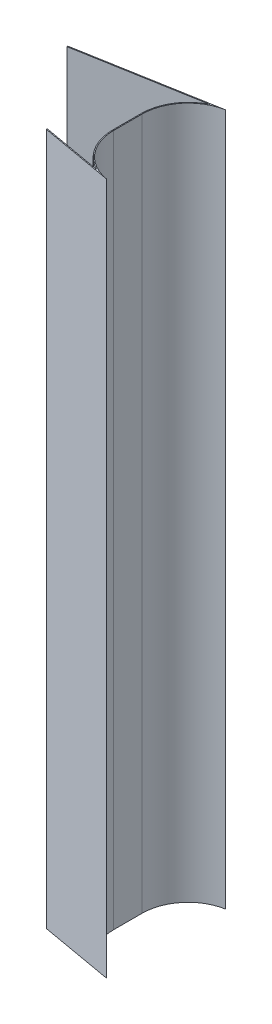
from build123d import *

# Parameters (mm, degrees)
BOSS_EXTRUDE1_DEPTH = 762


with BuildPart() as part:
    # Sketch1 → Boss-Extrude1 (new body)
    with BuildSketch(Plane(origin=(0, 0, 0), x_dir=(1, 0, 0), z_dir=(0, 1, 0))):
        with BuildLine():
            Line((-83.084484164, -50.275897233), (-3.004727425, -64.396118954))
            ThreePointArc((-3.004727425, -64.396118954), (-33.09845771, -47.021495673), (-44.9834, -14.367885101))
            Line((-44.9834, -14.367885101), (-44.9834, 16.946887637))
            ThreePointArc((-44.9834, 16.946887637), (-33.09845771, 49.600498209), (-3.004727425, 66.97512149))
            Line((-3.004727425, 66.97512149), (-150.876809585, 40.901283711))
            Line((-150.876809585, 40.901283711), (-150.700383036, 39.900719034))
            Line((-150.700383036, 39.900719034), (-16.97842224, 63.479508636))
            ThreePointArc((-16.97842224, 63.479508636), (-38.149550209, 44.367235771), (-45.9994, 16.946887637))
            Line((-45.9994, 16.946887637), (-45.9994, -14.367885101))
            ThreePointArc((-45.9994, -14.367885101), (-38.149550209, -41.788233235), (-16.97842224, -60.900506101))
            Line((-16.97842224, -60.900506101), (-82.908057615, -49.275332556))
            Line((-82.908057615, -49.275332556), (-83.084484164, -50.275897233))
        make_face()
    extrude(amount=BOSS_EXTRUDE1_DEPTH)


solid = part.part
